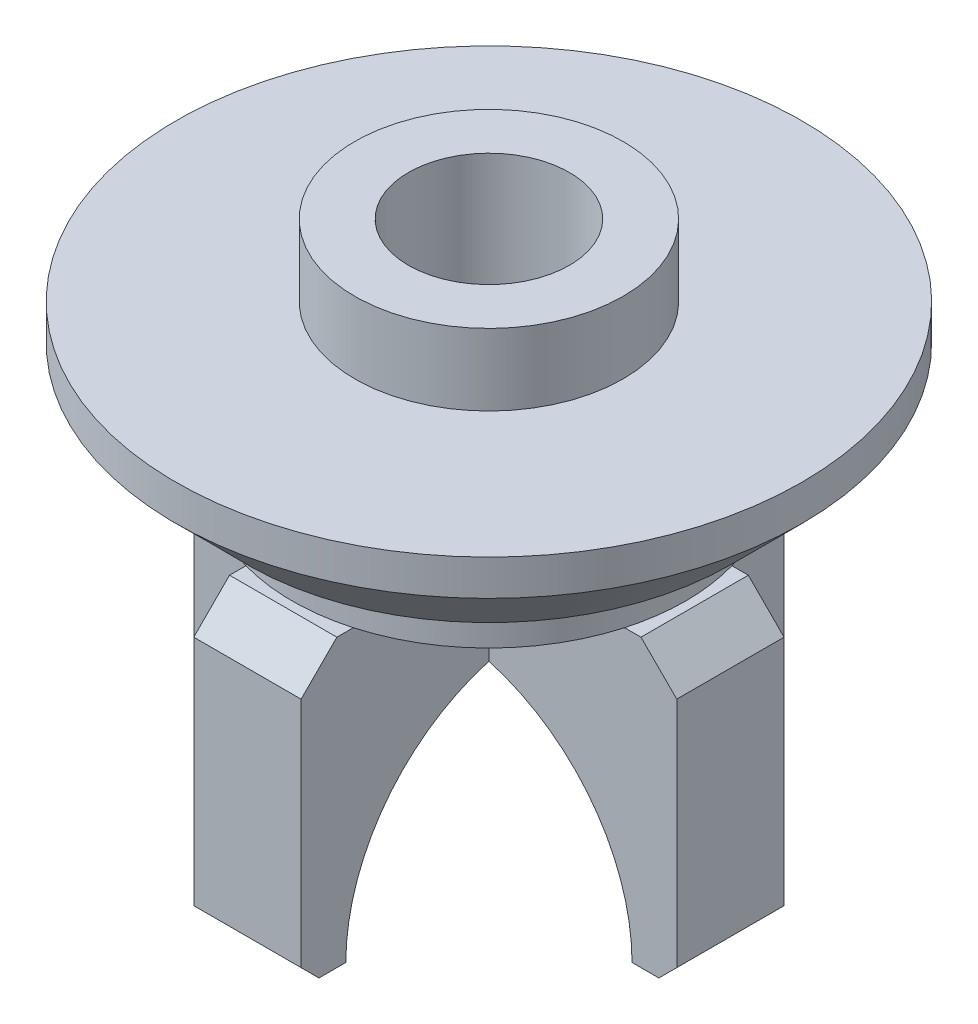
from build123d import *

# Parameters (mm, degrees)
BOSS_EXTRUDE1_DEPTH          = 3
CIRPATTERN1_COUNT            = 2
CIRPATTERN1_ANGLE            = 90
F_9_0_9_DIAMETER_HOLE1_D     = 9
F_9_0_9_DIAMETER_HOLE1_DEPTH = 10
F_9_0_9_DIAMETER_HOLE1_TIP   = 2.703872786


with BuildPart() as part:
    # Sketch1 → Revolve1 (revolve)
    with BuildSketch(Plane.XY):
        Polygon((0, 0), (11, 0), (11, 3), (13.5, 3), (17.5, 7), (17.5, 9), (7.5, 9), (7.5, 13), (0, 13), align=None)
    revolve(axis=Axis((0, 0, 0), (0, 1, 0)))

    # Sketch2 → Boss-Extrude1 (add, symmetric)
    with BuildSketch(Plane.XY):
        with BuildLine():
            Line((0, -5), (0, 0))
            Line((0, 0), (-11.5, 0))
            Line((-11.5, 0), (-13.5, -2))
            Line((-13.5, -2), (-13.5, -15))
            Line((-13.5, -15), (-12.5, -16))
            Line((-12.5, -16), (-11, -16))
            ThreePointArc((-11, -16), (-7.778174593, -8.221825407), (0, -5))
        make_face()
        with BuildLine():
            Line((11.5, 0), (0, 0))
            Line((0, 0), (0, -5))
            ThreePointArc((0, -5), (7.778174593, -8.221825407), (11, -16))
            Line((11, -16), (12.5, -16))
            Line((12.5, -16), (13.5, -15))
            Line((13.5, -15), (13.5, -2))
            Line((13.5, -2), (11.5, 0))
        make_face()
    boss_extrude1 = extrude(amount=BOSS_EXTRUDE1_DEPTH, both=True)

    # CirPattern1: Boss-Extrude1 ×2 about axis
    cirpattern1_axis = Axis((0, 0, 0), (0, -1, 0))
    for i in range(1, CIRPATTERN1_COUNT):
        add(boss_extrude1.rotate(cirpattern1_axis, i * CIRPATTERN1_ANGLE / (CIRPATTERN1_COUNT - 1)))

    # 9.0 _9_ Diameter Hole1
    with Locations(Plane(origin=(0, 13, 0), x_dir=(1, 0, 0), z_dir=(0, 1, 0))):
        with Locations((0, 0)):
            Hole(F_9_0_9_DIAMETER_HOLE1_D / 2, depth=F_9_0_9_DIAMETER_HOLE1_DEPTH)
            with Locations((0, 0, -(F_9_0_9_DIAMETER_HOLE1_DEPTH + F_9_0_9_DIAMETER_HOLE1_TIP / 2))):  # 118° drill point
                Cone(0, F_9_0_9_DIAMETER_HOLE1_D / 2, F_9_0_9_DIAMETER_HOLE1_TIP, mode=Mode.SUBTRACT)


solid = part.part
